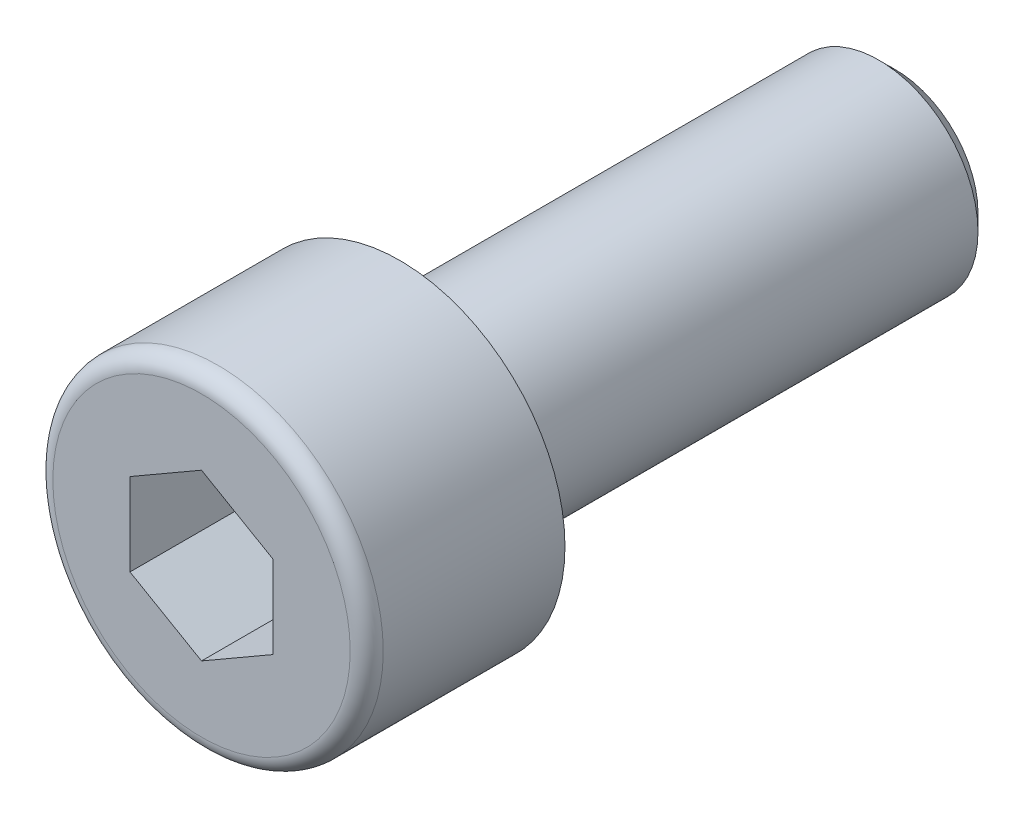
ISO-10303-21;
HEADER;
FILE_DESCRIPTION(('STEP AP214'),'2;1');
FILE_NAME('part.step','',(''),(''),'','','');
FILE_SCHEMA(('AUTOMOTIVE_DESIGN { 1 0 10303 214 1 1 1 1 }'));
ENDSEC;
DATA;
#1=APPLICATION_CONTEXT('core data for automotive mechanical design processes');
#2=APPLICATION_PROTOCOL_DEFINITION('international standard','automotive_design',2000,#1);
#3=PRODUCT_CONTEXT('',#1,'mechanical');
#4=PRODUCT('Part','Part','',(#3));
#5=PRODUCT_RELATED_PRODUCT_CATEGORY('part','',(#4));
#6=PRODUCT_DEFINITION_FORMATION('','',#4);
#7=PRODUCT_DEFINITION_CONTEXT('part definition',#1,'design');
#8=PRODUCT_DEFINITION('design','',#6,#7);
#9=PRODUCT_DEFINITION_SHAPE('','',#8);
#10=(LENGTH_UNIT() NAMED_UNIT(*) SI_UNIT(.MILLI.,.METRE.));
#11=(NAMED_UNIT(*) PLANE_ANGLE_UNIT() SI_UNIT($,.RADIAN.));
#12=(NAMED_UNIT(*) SI_UNIT($,.STERADIAN.) SOLID_ANGLE_UNIT());
#13=UNCERTAINTY_MEASURE_WITH_UNIT(LENGTH_MEASURE(1.E-05),#10,'distance_accuracy_value','');
#14=(GEOMETRIC_REPRESENTATION_CONTEXT(3) GLOBAL_UNCERTAINTY_ASSIGNED_CONTEXT((#13)) GLOBAL_UNIT_ASSIGNED_CONTEXT((#10,
#11,#12)) REPRESENTATION_CONTEXT('',''));
#15=CARTESIAN_POINT('',(0.,0.,0.));
#16=DIRECTION('',(0.,0.,1.));
#17=DIRECTION('',(1.,0.,0.));
#18=AXIS2_PLACEMENT_3D('',#15,#16,#17);
#19=CARTESIAN_POINT('',(0.,0.,15.));
#20=DIRECTION('',(0.,0.,-1.));
#21=DIRECTION('',(-1.,0.,0.));
#22=AXIS2_PLACEMENT_3D('',#19,#20,#21);
#23=CYLINDRICAL_SURFACE('',#22,3.);
#24=CARTESIAN_POINT('',(0.,0.,0.500000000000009));
#25=DIRECTION('',(0.,0.,1.));
#26=DIRECTION('',(1.,0.,0.));
#27=AXIS2_PLACEMENT_3D('',#24,#25,#26);
#28=CIRCLE('',#27,3.);
#29=CARTESIAN_POINT('',(3.,0.,0.500000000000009));
#30=VERTEX_POINT('',#29);
#31=EDGE_CURVE('E41',#30,#30,#28,.T.);
#32=ORIENTED_EDGE('',*,*,#31,.T.);
#33=EDGE_LOOP('',(#32));
#34=FACE_BOUND('',#33,.T.);
#35=CARTESIAN_POINT('',(0.,0.,15.));
#36=DIRECTION('',(0.,0.,1.));
#37=DIRECTION('',(1.,0.,0.));
#38=AXIS2_PLACEMENT_3D('',#35,#36,#37);
#39=CIRCLE('',#38,3.);
#40=CARTESIAN_POINT('',(3.,0.,15.));
#41=VERTEX_POINT('',#40);
#42=EDGE_CURVE('E144',#41,#41,#39,.T.);
#43=ORIENTED_EDGE('',*,*,#42,.F.);
#44=EDGE_LOOP('',(#43));
#45=FACE_BOUND('',#44,.T.);
#46=ADVANCED_FACE('F34',(#34,#45),#23,.T.);
#47=CARTESIAN_POINT('',(0.,0.,0.));
#48=DIRECTION('',(0.,0.,1.));
#49=DIRECTION('',(1.,0.,0.));
#50=AXIS2_PLACEMENT_3D('',#47,#48,#49);
#51=PLANE('',#50);
#52=CARTESIAN_POINT('',(0.,0.,0.));
#53=DIRECTION('',(0.,0.,1.));
#54=DIRECTION('',(1.,0.,0.));
#55=AXIS2_PLACEMENT_3D('',#52,#53,#54);
#56=CIRCLE('',#55,2.5);
#57=CARTESIAN_POINT('',(2.5,0.,0.));
#58=VERTEX_POINT('',#57);
#59=EDGE_CURVE('E11',#58,#58,#56,.F.);
#60=ORIENTED_EDGE('',*,*,#59,.T.);
#61=EDGE_LOOP('',(#60));
#62=FACE_BOUND('',#61,.T.);
#63=ADVANCED_FACE('F170',(#62),#51,.F.);
#64=CARTESIAN_POINT('',(0.,0.,15.));
#65=DIRECTION('',(0.,0.,1.));
#66=DIRECTION('',(1.,0.,0.));
#67=AXIS2_PLACEMENT_3D('',#64,#65,#66);
#68=PLANE('',#67);
#69=CARTESIAN_POINT('',(0.,0.,15.));
#70=DIRECTION('',(0.,0.,1.));
#71=DIRECTION('',(1.,0.,0.));
#72=AXIS2_PLACEMENT_3D('',#69,#70,#71);
#73=CIRCLE('',#72,5.);
#74=CARTESIAN_POINT('',(5.,0.,15.));
#75=VERTEX_POINT('',#74);
#76=EDGE_CURVE('E135',#75,#75,#73,.T.);
#77=ORIENTED_EDGE('',*,*,#76,.F.);
#78=EDGE_LOOP('',(#77));
#79=FACE_BOUND('',#78,.T.);
#80=ORIENTED_EDGE('',*,*,#42,.T.);
#81=EDGE_LOOP('',(#80));
#82=FACE_BOUND('',#81,.T.);
#83=ADVANCED_FACE('F174',(#79,#82),#68,.F.);
#84=CARTESIAN_POINT('',(0.,0.,21.));
#85=DIRECTION('',(0.,0.,-1.));
#86=DIRECTION('',(-1.,0.,0.));
#87=AXIS2_PLACEMENT_3D('',#84,#85,#86);
#88=CYLINDRICAL_SURFACE('',#87,5.);
#89=CARTESIAN_POINT('',(0.,0.,20.5));
#90=DIRECTION('',(0.,0.,1.));
#91=DIRECTION('',(1.,0.,0.));
#92=AXIS2_PLACEMENT_3D('',#89,#90,#91);
#93=CIRCLE('',#92,5.);
#94=CARTESIAN_POINT('',(5.,0.,20.5));
#95=VERTEX_POINT('',#94);
#96=EDGE_CURVE('E150',#95,#95,#93,.F.);
#97=ORIENTED_EDGE('',*,*,#96,.T.);
#98=EDGE_LOOP('',(#97));
#99=FACE_BOUND('',#98,.T.);
#100=ORIENTED_EDGE('',*,*,#76,.T.);
#101=EDGE_LOOP('',(#100));
#102=FACE_BOUND('',#101,.T.);
#103=ADVANCED_FACE('F179',(#99,#102),#88,.T.);
#104=CARTESIAN_POINT('',(0.,0.,21.));
#105=DIRECTION('',(0.,0.,1.));
#106=DIRECTION('',(1.,0.,0.));
#107=AXIS2_PLACEMENT_3D('',#104,#105,#106);
#108=PLANE('',#107);
#109=CARTESIAN_POINT('',(0.,0.,21.));
#110=DIRECTION('',(0.,0.,1.));
#111=DIRECTION('',(1.,0.,0.));
#112=AXIS2_PLACEMENT_3D('',#109,#110,#111);
#113=CIRCLE('',#112,4.5);
#114=CARTESIAN_POINT('',(4.5,0.,21.));
#115=VERTEX_POINT('',#114);
#116=EDGE_CURVE('E147',#115,#115,#113,.T.);
#117=ORIENTED_EDGE('',*,*,#116,.T.);
#118=EDGE_LOOP('',(#117));
#119=FACE_BOUND('',#118,.T.);
#120=DIRECTION('',(-0.866025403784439,0.5,0.));
#121=VECTOR('',#120,1.);
#122=CARTESIAN_POINT('',(2.1650635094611,1.25,21.));
#123=LINE('',#122,#121);
#124=CARTESIAN_POINT('',(2.1650635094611,1.25,21.));
#125=VERTEX_POINT('',#124);
#126=CARTESIAN_POINT('',(0.,2.5,21.));
#127=VERTEX_POINT('',#126);
#128=EDGE_CURVE('E48',#125,#127,#123,.T.);
#129=ORIENTED_EDGE('',*,*,#128,.F.);
#130=DIRECTION('',(0.,1.,0.));
#131=VECTOR('',#130,1.);
#132=CARTESIAN_POINT('',(2.1650635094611,-1.25,21.));
#133=LINE('',#132,#131);
#134=CARTESIAN_POINT('',(2.1650635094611,-1.25,21.));
#135=VERTEX_POINT('',#134);
#136=EDGE_CURVE('E117',#135,#125,#133,.T.);
#137=ORIENTED_EDGE('',*,*,#136,.F.);
#138=DIRECTION('',(0.866025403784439,0.5,0.));
#139=VECTOR('',#138,1.);
#140=CARTESIAN_POINT('',(0.,-2.5,21.));
#141=LINE('',#140,#139);
#142=CARTESIAN_POINT('',(0.,-2.5,21.));
#143=VERTEX_POINT('',#142);
#144=EDGE_CURVE('E111',#143,#135,#141,.T.);
#145=ORIENTED_EDGE('',*,*,#144,.F.);
#146=DIRECTION('',(0.866025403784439,-0.5,0.));
#147=VECTOR('',#146,1.);
#148=CARTESIAN_POINT('',(-2.1650635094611,-1.25,21.));
#149=LINE('',#148,#147);
#150=CARTESIAN_POINT('',(-2.1650635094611,-1.25,21.));
#151=VERTEX_POINT('',#150);
#152=EDGE_CURVE('E109',#151,#143,#149,.T.);
#153=ORIENTED_EDGE('',*,*,#152,.F.);
#154=DIRECTION('',(0.,-1.,0.));
#155=VECTOR('',#154,1.);
#156=CARTESIAN_POINT('',(-2.1650635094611,1.25,21.));
#157=LINE('',#156,#155);
#158=CARTESIAN_POINT('',(-2.1650635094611,1.25,21.));
#159=VERTEX_POINT('',#158);
#160=EDGE_CURVE('E91',#159,#151,#157,.T.);
#161=ORIENTED_EDGE('',*,*,#160,.F.);
#162=DIRECTION('',(-0.866025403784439,-0.5,0.));
#163=VECTOR('',#162,1.);
#164=CARTESIAN_POINT('',(0.,2.5,21.));
#165=LINE('',#164,#163);
#166=EDGE_CURVE('E102',#127,#159,#165,.T.);
#167=ORIENTED_EDGE('',*,*,#166,.F.);
#168=EDGE_LOOP('',(#129,#137,#145,#153,#161,#167));
#169=FACE_BOUND('',#168,.T.);
#170=ADVANCED_FACE('F106',(#119,#169),#108,.T.);
#171=CARTESIAN_POINT('',(2.1650635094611,1.25,17.5));
#172=DIRECTION('',(0.5,0.866025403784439,0.));
#173=DIRECTION('',(-0.866025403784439,0.5,0.));
#174=AXIS2_PLACEMENT_3D('',#171,#172,#173);
#175=PLANE('',#174);
#176=ORIENTED_EDGE('',*,*,#128,.T.);
#177=DIRECTION('',(0.,0.,1.));
#178=VECTOR('',#177,1.);
#179=CARTESIAN_POINT('',(0.,2.5,17.5));
#180=LINE('',#179,#178);
#181=CARTESIAN_POINT('',(0.,2.5,17.5));
#182=VERTEX_POINT('',#181);
#183=EDGE_CURVE('E99',#182,#127,#180,.T.);
#184=ORIENTED_EDGE('',*,*,#183,.F.);
#185=DIRECTION('',(-0.866025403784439,0.5,0.));
#186=VECTOR('',#185,1.);
#187=CARTESIAN_POINT('',(2.1650635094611,1.25,17.5));
#188=LINE('',#187,#186);
#189=CARTESIAN_POINT('',(2.1650635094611,1.25,17.5));
#190=VERTEX_POINT('',#189);
#191=EDGE_CURVE('E119',#190,#182,#188,.T.);
#192=ORIENTED_EDGE('',*,*,#191,.F.);
#193=DIRECTION('',(0.,0.,1.));
#194=VECTOR('',#193,1.);
#195=CARTESIAN_POINT('',(2.1650635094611,1.25,17.5));
#196=LINE('',#195,#194);
#197=EDGE_CURVE('E55',#190,#125,#196,.T.);
#198=ORIENTED_EDGE('',*,*,#197,.T.);
#199=EDGE_LOOP('',(#176,#184,#192,#198));
#200=FACE_BOUND('',#199,.T.);
#201=ADVANCED_FACE('F187',(#200),#175,.F.);
#202=CARTESIAN_POINT('',(2.1650635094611,-1.25,17.5));
#203=DIRECTION('',(1.,0.,0.));
#204=DIRECTION('',(0.,1.,0.));
#205=AXIS2_PLACEMENT_3D('',#202,#203,#204);
#206=PLANE('',#205);
#207=ORIENTED_EDGE('',*,*,#136,.T.);
#208=ORIENTED_EDGE('',*,*,#197,.F.);
#209=DIRECTION('',(0.,1.,0.));
#210=VECTOR('',#209,1.);
#211=CARTESIAN_POINT('',(2.1650635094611,-1.25,17.5));
#212=LINE('',#211,#210);
#213=CARTESIAN_POINT('',(2.1650635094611,-1.25,17.5));
#214=VERTEX_POINT('',#213);
#215=EDGE_CURVE('E131',#214,#190,#212,.T.);
#216=ORIENTED_EDGE('',*,*,#215,.F.);
#217=DIRECTION('',(0.,0.,1.));
#218=VECTOR('',#217,1.);
#219=CARTESIAN_POINT('',(2.1650635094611,-1.25,17.5));
#220=LINE('',#219,#218);
#221=EDGE_CURVE('E136',#214,#135,#220,.T.);
#222=ORIENTED_EDGE('',*,*,#221,.T.);
#223=EDGE_LOOP('',(#207,#208,#216,#222));
#224=FACE_BOUND('',#223,.T.);
#225=ADVANCED_FACE('F192',(#224),#206,.F.);
#226=CARTESIAN_POINT('',(0.,-2.5,17.5));
#227=DIRECTION('',(0.5,-0.866025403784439,0.));
#228=DIRECTION('',(0.866025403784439,0.5,0.));
#229=AXIS2_PLACEMENT_3D('',#226,#227,#228);
#230=PLANE('',#229);
#231=ORIENTED_EDGE('',*,*,#144,.T.);
#232=ORIENTED_EDGE('',*,*,#221,.F.);
#233=DIRECTION('',(0.866025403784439,0.5,0.));
#234=VECTOR('',#233,1.);
#235=CARTESIAN_POINT('',(0.,-2.5,17.5));
#236=LINE('',#235,#234);
#237=CARTESIAN_POINT('',(0.,-2.5,17.5));
#238=VERTEX_POINT('',#237);
#239=EDGE_CURVE('E128',#238,#214,#236,.T.);
#240=ORIENTED_EDGE('',*,*,#239,.F.);
#241=DIRECTION('',(0.,0.,1.));
#242=VECTOR('',#241,1.);
#243=CARTESIAN_POINT('',(0.,-2.5,17.5));
#244=LINE('',#243,#242);
#245=EDGE_CURVE('E138',#238,#143,#244,.T.);
#246=ORIENTED_EDGE('',*,*,#245,.T.);
#247=EDGE_LOOP('',(#231,#232,#240,#246));
#248=FACE_BOUND('',#247,.T.);
#249=ADVANCED_FACE('F200',(#248),#230,.F.);
#250=CARTESIAN_POINT('',(-2.1650635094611,-1.25,17.5));
#251=DIRECTION('',(-0.5,-0.866025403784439,0.));
#252=DIRECTION('',(0.866025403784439,-0.5,0.));
#253=AXIS2_PLACEMENT_3D('',#250,#251,#252);
#254=PLANE('',#253);
#255=ORIENTED_EDGE('',*,*,#152,.T.);
#256=ORIENTED_EDGE('',*,*,#245,.F.);
#257=DIRECTION('',(0.866025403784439,-0.5,0.));
#258=VECTOR('',#257,1.);
#259=CARTESIAN_POINT('',(-2.1650635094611,-1.25,17.5));
#260=LINE('',#259,#258);
#261=CARTESIAN_POINT('',(-2.1650635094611,-1.25,17.5));
#262=VERTEX_POINT('',#261);
#263=EDGE_CURVE('E125',#262,#238,#260,.T.);
#264=ORIENTED_EDGE('',*,*,#263,.F.);
#265=DIRECTION('',(0.,0.,1.));
#266=VECTOR('',#265,1.);
#267=CARTESIAN_POINT('',(-2.1650635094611,-1.25,17.5));
#268=LINE('',#267,#266);
#269=EDGE_CURVE('E98',#262,#151,#268,.T.);
#270=ORIENTED_EDGE('',*,*,#269,.T.);
#271=EDGE_LOOP('',(#255,#256,#264,#270));
#272=FACE_BOUND('',#271,.T.);
#273=ADVANCED_FACE('F197',(#272),#254,.F.);
#274=CARTESIAN_POINT('',(-2.1650635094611,1.25,17.5));
#275=DIRECTION('',(-1.,0.,0.));
#276=DIRECTION('',(0.,-1.,0.));
#277=AXIS2_PLACEMENT_3D('',#274,#275,#276);
#278=PLANE('',#277);
#279=ORIENTED_EDGE('',*,*,#160,.T.);
#280=ORIENTED_EDGE('',*,*,#269,.F.);
#281=DIRECTION('',(0.,-1.,0.));
#282=VECTOR('',#281,1.);
#283=CARTESIAN_POINT('',(-2.1650635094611,1.25,17.5));
#284=LINE('',#283,#282);
#285=CARTESIAN_POINT('',(-2.1650635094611,1.25,17.5));
#286=VERTEX_POINT('',#285);
#287=EDGE_CURVE('E94',#286,#262,#284,.T.);
#288=ORIENTED_EDGE('',*,*,#287,.F.);
#289=DIRECTION('',(0.,0.,1.));
#290=VECTOR('',#289,1.);
#291=CARTESIAN_POINT('',(-2.1650635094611,1.25,17.5));
#292=LINE('',#291,#290);
#293=EDGE_CURVE('E87',#286,#159,#292,.T.);
#294=ORIENTED_EDGE('',*,*,#293,.T.);
#295=EDGE_LOOP('',(#279,#280,#288,#294));
#296=FACE_BOUND('',#295,.T.);
#297=ADVANCED_FACE('F89',(#296),#278,.F.);
#298=CARTESIAN_POINT('',(0.,2.5,17.5));
#299=DIRECTION('',(-0.5,0.866025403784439,0.));
#300=DIRECTION('',(-0.866025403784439,-0.5,0.));
#301=AXIS2_PLACEMENT_3D('',#298,#299,#300);
#302=PLANE('',#301);
#303=ORIENTED_EDGE('',*,*,#166,.T.);
#304=ORIENTED_EDGE('',*,*,#293,.F.);
#305=DIRECTION('',(-0.866025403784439,-0.5,0.));
#306=VECTOR('',#305,1.);
#307=CARTESIAN_POINT('',(0.,2.5,17.5));
#308=LINE('',#307,#306);
#309=EDGE_CURVE('E122',#182,#286,#308,.T.);
#310=ORIENTED_EDGE('',*,*,#309,.F.);
#311=ORIENTED_EDGE('',*,*,#183,.T.);
#312=EDGE_LOOP('',(#303,#304,#310,#311));
#313=FACE_BOUND('',#312,.T.);
#314=ADVANCED_FACE('F103',(#313),#302,.F.);
#315=CARTESIAN_POINT('',(2.1650635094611,1.25,17.5));
#316=DIRECTION('',(0.,0.,-1.));
#317=DIRECTION('',(-1.,0.,0.));
#318=AXIS2_PLACEMENT_3D('',#315,#316,#317);
#319=PLANE('',#318);
#320=ORIENTED_EDGE('',*,*,#191,.T.);
#321=ORIENTED_EDGE('',*,*,#309,.T.);
#322=ORIENTED_EDGE('',*,*,#287,.T.);
#323=ORIENTED_EDGE('',*,*,#263,.T.);
#324=ORIENTED_EDGE('',*,*,#239,.T.);
#325=ORIENTED_EDGE('',*,*,#215,.T.);
#326=EDGE_LOOP('',(#320,#321,#322,#323,#324,#325));
#327=FACE_BOUND('',#326,.T.);
#328=ADVANCED_FACE('F165',(#327),#319,.F.);
#329=CARTESIAN_POINT('',(0.,0.,20.5));
#330=DIRECTION('',(0.,0.,1.));
#331=DIRECTION('',(1.,0.,0.));
#332=AXIS2_PLACEMENT_3D('',#329,#330,#331);
#333=TOROIDAL_SURFACE('',#332,4.5,0.5);
#334=ORIENTED_EDGE('',*,*,#96,.F.);
#335=EDGE_LOOP('',(#334));
#336=FACE_BOUND('',#335,.T.);
#337=ORIENTED_EDGE('',*,*,#116,.F.);
#338=EDGE_LOOP('',(#337));
#339=FACE_BOUND('',#338,.T.);
#340=ADVANCED_FACE('F159',(#336,#339),#333,.T.);
#341=CARTESIAN_POINT('',(0.,0.,0.500000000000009));
#342=DIRECTION('',(0.,0.,1.));
#343=DIRECTION('',(1.,0.,0.));
#344=AXIS2_PLACEMENT_3D('',#341,#342,#343);
#345=CONICAL_SURFACE('',#344,3.,0.785398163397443);
#346=ORIENTED_EDGE('',*,*,#59,.F.);
#347=EDGE_LOOP('',(#346));
#348=FACE_BOUND('',#347,.T.);
#349=ORIENTED_EDGE('',*,*,#31,.F.);
#350=EDGE_LOOP('',(#349));
#351=FACE_BOUND('',#350,.T.);
#352=ADVANCED_FACE('F157',(#348,#351),#345,.T.);
#353=CLOSED_SHELL('',(#46,#63,#83,#103,#170,#201,#225,#249,#273,#297,#314,#328,#340,#352));
#354=MANIFOLD_SOLID_BREP('B2',#353);
#355=ADVANCED_BREP_SHAPE_REPRESENTATION('',(#18,#354),#14);
#356=SHAPE_DEFINITION_REPRESENTATION(#9,#355);
ENDSEC;
END-ISO-10303-21;
